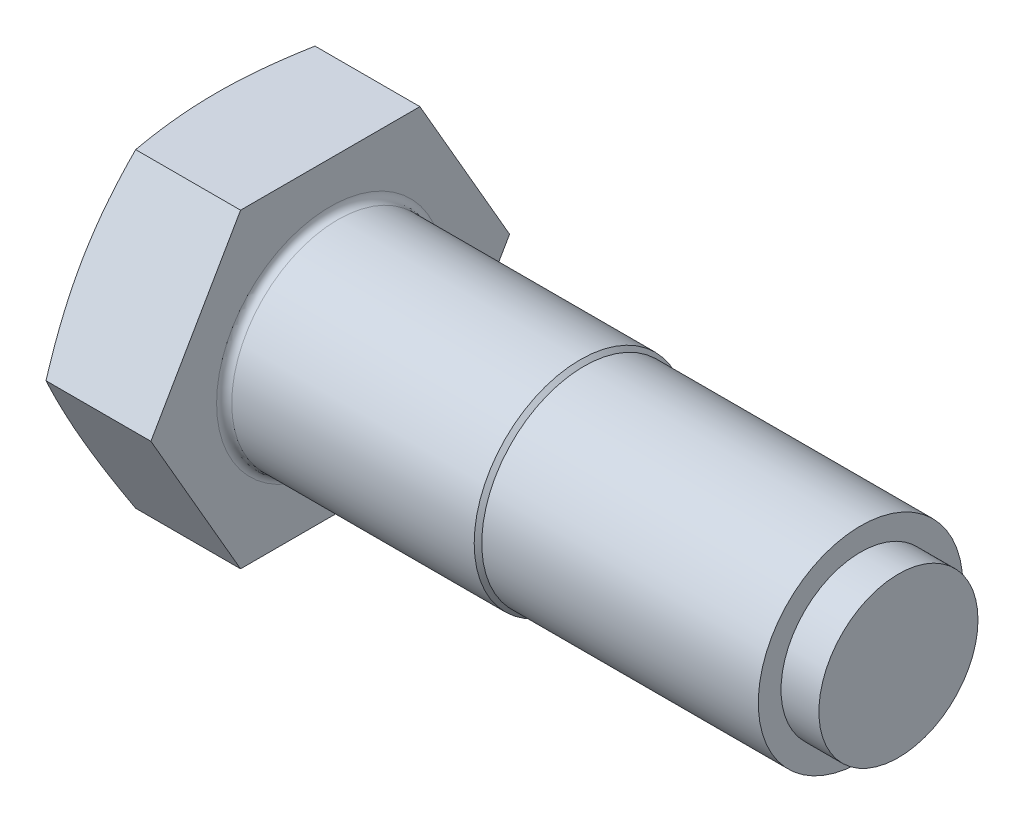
ISO-10303-21;
HEADER;
FILE_DESCRIPTION(('STEP AP214'),'2;1');
FILE_NAME('part.step','',(''),(''),'','','');
FILE_SCHEMA(('AUTOMOTIVE_DESIGN { 1 0 10303 214 1 1 1 1 }'));
ENDSEC;
DATA;
#1=APPLICATION_CONTEXT('core data for automotive mechanical design processes');
#2=APPLICATION_PROTOCOL_DEFINITION('international standard','automotive_design',2000,#1);
#3=PRODUCT_CONTEXT('',#1,'mechanical');
#4=PRODUCT('Part','Part','',(#3));
#5=PRODUCT_RELATED_PRODUCT_CATEGORY('part','',(#4));
#6=PRODUCT_DEFINITION_FORMATION('','',#4);
#7=PRODUCT_DEFINITION_CONTEXT('part definition',#1,'design');
#8=PRODUCT_DEFINITION('design','',#6,#7);
#9=PRODUCT_DEFINITION_SHAPE('','',#8);
#10=(LENGTH_UNIT() NAMED_UNIT(*) SI_UNIT(.MILLI.,.METRE.));
#11=(NAMED_UNIT(*) PLANE_ANGLE_UNIT() SI_UNIT($,.RADIAN.));
#12=(NAMED_UNIT(*) SI_UNIT($,.STERADIAN.) SOLID_ANGLE_UNIT());
#13=UNCERTAINTY_MEASURE_WITH_UNIT(LENGTH_MEASURE(1.E-05),#10,'distance_accuracy_value','');
#14=(GEOMETRIC_REPRESENTATION_CONTEXT(3) GLOBAL_UNCERTAINTY_ASSIGNED_CONTEXT((#13)) GLOBAL_UNIT_ASSIGNED_CONTEXT((#10,
#11,#12)) REPRESENTATION_CONTEXT('',''));
#15=CARTESIAN_POINT('',(0.,0.,0.));
#16=DIRECTION('',(0.,0.,1.));
#17=DIRECTION('',(1.,0.,0.));
#18=AXIS2_PLACEMENT_3D('',#15,#16,#17);
#19=CARTESIAN_POINT('',(15.,-20.5,-11.8356805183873));
#20=DIRECTION('',(0.,0.5,0.866025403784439));
#21=DIRECTION('',(0.,-0.866025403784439,0.5));
#22=AXIS2_PLACEMENT_3D('',#19,#20,#21);
#23=PLANE('',#22);
#24=CARTESIAN_POINT('',(1.15432304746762,0.00020000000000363,-23.6714765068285));
#25=CARTESIAN_POINT('',(1.06511686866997,-0.424342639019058,-23.4263666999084));
#26=CARTESIAN_POINT('',(0.979922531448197,-0.849509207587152,-23.1808966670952));
#27=CARTESIAN_POINT('',(0.818440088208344,-1.70114813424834,-22.689202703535));
#28=CARTESIAN_POINT('',(0.742152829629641,-2.12762061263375,-22.4429787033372));
#29=CARTESIAN_POINT('',(0.527901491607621,-3.40955299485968,-21.7028546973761));
#30=CARTESIAN_POINT('',(0.404673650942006,-4.26694095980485,-21.2078415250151));
#31=CARTESIAN_POINT('',(0.254912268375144,-5.55194696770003,-20.4659429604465));
#32=CARTESIAN_POINT('',(0.210965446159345,-5.97808243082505,-20.2199135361));
#33=CARTESIAN_POINT('',(0.135072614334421,-6.83114899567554,-19.7273953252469));
#34=CARTESIAN_POINT('',(0.103126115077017,-7.25808006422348,-19.4809065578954));
#35=CARTESIAN_POINT('',(0.051791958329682,-8.11236258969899,-18.9876863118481));
#36=CARTESIAN_POINT('',(0.0324000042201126,-8.53971385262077,-18.7409549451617));
#37=CARTESIAN_POINT('',(0.00650404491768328,-9.39471007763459,-18.2473226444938));
#38=CARTESIAN_POINT('',(0.,-9.8223550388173,-18.0004217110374));
#39=CARTESIAN_POINT('',(0.,-10.6776449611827,-17.5066198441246));
#40=CARTESIAN_POINT('',(0.00650404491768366,-11.1052899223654,-17.2597189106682));
#41=CARTESIAN_POINT('',(0.0324000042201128,-11.9602861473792,-16.7660866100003));
#42=CARTESIAN_POINT('',(0.0517919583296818,-12.387637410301,-16.5193552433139));
#43=CARTESIAN_POINT('',(0.103126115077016,-13.2419199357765,-16.0261349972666));
#44=CARTESIAN_POINT('',(0.135072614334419,-13.6688510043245,-15.7796462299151));
#45=CARTESIAN_POINT('',(0.210965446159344,-14.5219175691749,-15.287128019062));
#46=CARTESIAN_POINT('',(0.254912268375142,-14.9480530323,-15.0410985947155));
#47=CARTESIAN_POINT('',(0.404673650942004,-16.2330590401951,-14.2992000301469));
#48=CARTESIAN_POINT('',(0.527901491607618,-17.0904470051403,-13.8041868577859));
#49=CARTESIAN_POINT('',(0.742152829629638,-18.3723793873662,-13.0640628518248));
#50=CARTESIAN_POINT('',(0.818440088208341,-18.7988518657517,-12.817838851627));
#51=CARTESIAN_POINT('',(0.979922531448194,-19.6504907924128,-12.3261448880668));
#52=CARTESIAN_POINT('',(1.06511686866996,-20.0756573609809,-12.0806748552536));
#53=CARTESIAN_POINT('',(1.15432304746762,-20.5002,-11.8355650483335));
#54=B_SPLINE_CURVE_WITH_KNOTS('',3,(#24,#25,#26,#27,#28,#29,#30,#31,#32,#33,#34,#35,#36,#37,#38,
#39,#40,#41,#42,#43,#44,#45,#46,#47,#48,#49,#50,#51,#52,#53),.UNSPECIFIED.,.F.,.F.,(4,2,2,2,2,2,
2,2,2,2,2,2,2,2,4),(0.,1.49476565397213,2.98967340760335,5.98155544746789,7.46349089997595,
8.94536587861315,10.4267334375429,11.9080964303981,13.3894594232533,14.8708269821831,
16.3527019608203,17.8346374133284,20.8265194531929,22.3214272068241,23.8161928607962),.UNSPECIFIED.);
#55=CARTESIAN_POINT('',(1.15428101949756,0.,-23.6713610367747));
#56=VERTEX_POINT('',#55);
#57=CARTESIAN_POINT('',(0.,-10.25,-17.753520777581));
#58=VERTEX_POINT('',#57);
#59=EDGE_CURVE('E113',#56,#58,#54,.T.);
#60=ORIENTED_EDGE('',*,*,#59,.F.);
#61=DIRECTION('',(-1.,0.,0.));
#62=VECTOR('',#61,1.);
#63=CARTESIAN_POINT('',(15.,0.,-23.6713610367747));
#64=LINE('',#63,#62);
#65=CARTESIAN_POINT('',(15.,0.,-23.6713610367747));
#66=VERTEX_POINT('',#65);
#67=EDGE_CURVE('E142',#66,#56,#64,.T.);
#68=ORIENTED_EDGE('',*,*,#67,.F.);
#69=DIRECTION('',(0.,0.866025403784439,-0.5));
#70=VECTOR('',#69,1.);
#71=CARTESIAN_POINT('',(15.,-20.5,-11.8356805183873));
#72=LINE('',#71,#70);
#73=CARTESIAN_POINT('',(15.,-20.5,-11.8356805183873));
#74=VERTEX_POINT('',#73);
#75=EDGE_CURVE('E179',#74,#66,#72,.T.);
#76=ORIENTED_EDGE('',*,*,#75,.F.);
#77=DIRECTION('',(-1.,0.,0.));
#78=VECTOR('',#77,1.);
#79=CARTESIAN_POINT('',(15.,-20.5,-11.8356805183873));
#80=LINE('',#79,#78);
#81=CARTESIAN_POINT('',(1.15428101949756,-20.5,-11.8356805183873));
#82=VERTEX_POINT('',#81);
#83=EDGE_CURVE('E136',#74,#82,#80,.T.);
#84=ORIENTED_EDGE('',*,*,#83,.T.);
#85=EDGE_CURVE('E200',#58,#82,#54,.T.);
#86=ORIENTED_EDGE('',*,*,#85,.F.);
#87=EDGE_LOOP('',(#60,#68,#76,#84,#86));
#88=FACE_BOUND('',#87,.T.);
#89=ADVANCED_FACE('F35',(#88),#23,.F.);
#90=CARTESIAN_POINT('',(15.,0.,-23.6713610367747));
#91=DIRECTION('',(0.,-0.5,0.866025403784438));
#92=DIRECTION('',(0.,-0.866025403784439,-0.5));
#93=AXIS2_PLACEMENT_3D('',#90,#91,#92);
#94=PLANE('',#93);
#95=CARTESIAN_POINT('',(1.15432304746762,20.5002,-11.8355650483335));
#96=CARTESIAN_POINT('',(1.06511686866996,20.0756573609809,-12.0806748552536));
#97=CARTESIAN_POINT('',(0.979922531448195,19.6504907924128,-12.3261448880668));
#98=CARTESIAN_POINT('',(0.818440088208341,18.7988518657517,-12.817838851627));
#99=CARTESIAN_POINT('',(0.742152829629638,18.3723793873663,-13.0640628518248));
#100=CARTESIAN_POINT('',(0.527901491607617,17.0904470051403,-13.8041868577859));
#101=CARTESIAN_POINT('',(0.404673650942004,16.2330590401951,-14.2992000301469));
#102=CARTESIAN_POINT('',(0.254912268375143,14.9480530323,-15.0410985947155));
#103=CARTESIAN_POINT('',(0.210965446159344,14.5219175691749,-15.2871280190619));
#104=CARTESIAN_POINT('',(0.13507261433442,13.6688510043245,-15.779646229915));
#105=CARTESIAN_POINT('',(0.103126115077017,13.2419199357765,-16.0261349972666));
#106=CARTESIAN_POINT('',(0.0517919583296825,12.387637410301,-16.5193552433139));
#107=CARTESIAN_POINT('',(0.0324000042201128,11.9602861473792,-16.7660866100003));
#108=CARTESIAN_POINT('',(0.00650404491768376,11.1052899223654,-17.2597189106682));
#109=CARTESIAN_POINT('',(0.,10.6776449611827,-17.5066198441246));
#110=CARTESIAN_POINT('',(0.,9.8223550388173,-18.0004217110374));
#111=CARTESIAN_POINT('',(0.00650404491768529,9.3947100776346,-18.2473226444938));
#112=CARTESIAN_POINT('',(0.0324000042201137,8.53971385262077,-18.7409549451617));
#113=CARTESIAN_POINT('',(0.051791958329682,8.11236258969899,-18.9876863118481));
#114=CARTESIAN_POINT('',(0.103126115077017,7.25808006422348,-19.4809065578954));
#115=CARTESIAN_POINT('',(0.13507261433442,6.83114899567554,-19.7273953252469));
#116=CARTESIAN_POINT('',(0.210965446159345,5.97808243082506,-20.2199135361));
#117=CARTESIAN_POINT('',(0.254912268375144,5.55194696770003,-20.4659429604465));
#118=CARTESIAN_POINT('',(0.404673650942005,4.26694095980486,-21.2078415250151));
#119=CARTESIAN_POINT('',(0.527901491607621,3.40955299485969,-21.7028546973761));
#120=CARTESIAN_POINT('',(0.742152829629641,2.12762061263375,-22.4429787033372));
#121=CARTESIAN_POINT('',(0.818440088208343,1.70114813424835,-22.689202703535));
#122=CARTESIAN_POINT('',(0.979922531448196,0.849509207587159,-23.1808966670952));
#123=CARTESIAN_POINT('',(1.06511686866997,0.424342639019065,-23.4263666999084));
#124=CARTESIAN_POINT('',(1.15432304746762,-0.000199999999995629,-23.6714765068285));
#125=B_SPLINE_CURVE_WITH_KNOTS('',3,(#95,#96,#97,#98,#99,#100,#101,#102,#103,#104,#105,#106,
#107,#108,#109,#110,#111,#112,#113,#114,#115,#116,#117,#118,#119,#120,#121,#122,#123,#124),
.UNSPECIFIED.,.F.,.F.,(4,2,2,2,2,2,2,2,2,2,2,2,2,2,4),(0.,1.49476565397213,2.98967340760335,
5.98155544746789,7.46349089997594,8.94536587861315,10.4267334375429,11.9080964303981,
13.3894594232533,14.8708269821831,16.3527019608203,17.8346374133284,20.8265194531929,
22.3214272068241,23.8161928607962),.UNSPECIFIED.);
#126=CARTESIAN_POINT('',(1.15428101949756,20.5,-11.8356805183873));
#127=VERTEX_POINT('',#126);
#128=CARTESIAN_POINT('',(0.,10.25,-17.753520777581));
#129=VERTEX_POINT('',#128);
#130=EDGE_CURVE('E252',#127,#129,#125,.T.);
#131=ORIENTED_EDGE('',*,*,#130,.F.);
#132=DIRECTION('',(-1.,0.,0.));
#133=VECTOR('',#132,1.);
#134=CARTESIAN_POINT('',(15.,20.5,-11.8356805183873));
#135=LINE('',#134,#133);
#136=CARTESIAN_POINT('',(15.,20.5,-11.8356805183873));
#137=VERTEX_POINT('',#136);
#138=EDGE_CURVE('E133',#137,#127,#135,.T.);
#139=ORIENTED_EDGE('',*,*,#138,.F.);
#140=DIRECTION('',(0.,0.866025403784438,0.5));
#141=VECTOR('',#140,1.);
#142=CARTESIAN_POINT('',(15.,0.,-23.6713610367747));
#143=LINE('',#142,#141);
#144=EDGE_CURVE('E182',#66,#137,#143,.T.);
#145=ORIENTED_EDGE('',*,*,#144,.F.);
#146=ORIENTED_EDGE('',*,*,#67,.T.);
#147=EDGE_CURVE('E125',#129,#56,#125,.T.);
#148=ORIENTED_EDGE('',*,*,#147,.F.);
#149=EDGE_LOOP('',(#131,#139,#145,#146,#148));
#150=FACE_BOUND('',#149,.T.);
#151=ADVANCED_FACE('F258',(#150),#94,.F.);
#152=CARTESIAN_POINT('',(15.,20.5,-11.8356805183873));
#153=DIRECTION('',(0.,-1.,0.));
#154=DIRECTION('',(0.,0.,-1.));
#155=AXIS2_PLACEMENT_3D('',#152,#153,#154);
#156=PLANE('',#155);
#157=CARTESIAN_POINT('',(6.16802000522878,20.5,-31.3367203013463));
#158=CARTESIAN_POINT('',(6.02677468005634,20.5,-30.8729800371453));
#159=CARTESIAN_POINT('',(5.88638353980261,20.5,-30.4089797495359));
#160=CARTESIAN_POINT('',(5.60750085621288,20.5,-29.4804058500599));
#161=CARTESIAN_POINT('',(5.46900932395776,20.5,-29.0158322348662));
#162=CARTESIAN_POINT('',(5.05665312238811,20.5,-27.6211108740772));
#163=CARTESIAN_POINT('',(4.78592778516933,20.5,-26.6900311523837));
#164=CARTESIAN_POINT('',(4.25428153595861,20.5,-24.8231913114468));
#165=CARTESIAN_POINT('',(3.99337985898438,20.5,-23.8874257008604));
#166=CARTESIAN_POINT('',(3.4844130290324,20.5,-22.012414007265));
#167=CARTESIAN_POINT('',(3.23634764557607,20.5,-21.0731679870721));
#168=CARTESIAN_POINT('',(2.75919939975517,20.5,-19.2021753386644));
#169=CARTESIAN_POINT('',(2.52992020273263,20.5,-18.2704790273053));
#170=CARTESIAN_POINT('',(2.09088187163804,20.5,-16.4024501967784));
#171=CARTESIAN_POINT('',(1.88112306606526,20.5,-15.466117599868));
#172=CARTESIAN_POINT('',(1.48601627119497,20.5,-13.5886066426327));
#173=CARTESIAN_POINT('',(1.30065995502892,20.5,-12.6474300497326));
#174=CARTESIAN_POINT('',(0.960002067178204,20.5,-10.7596126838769));
#175=CARTESIAN_POINT('',(0.804699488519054,20.5,-9.81297209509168));
#176=CARTESIAN_POINT('',(0.545835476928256,20.5,-8.02082218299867));
#177=CARTESIAN_POINT('',(0.438425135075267,20.5,-7.17587403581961));
#178=CARTESIAN_POINT('',(0.256605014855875,20.5,-5.48240488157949));
#179=CARTESIAN_POINT('',(0.182194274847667,20.5,-4.63388397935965));
#180=CARTESIAN_POINT('',(0.0699568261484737,20.5,-2.93499042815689));
#181=CARTESIAN_POINT('',(0.0321042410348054,20.5,-2.08461951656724));
#182=CARTESIAN_POINT('',(-0.00510042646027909,20.5,-0.383026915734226));
#183=CARTESIAN_POINT('',(-0.00445278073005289,20.5,0.46819476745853));
#184=CARTESIAN_POINT('',(0.0354086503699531,20.5,2.17403898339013));
#185=CARTESIAN_POINT('',(0.074818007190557,20.5,3.02865687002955));
#186=CARTESIAN_POINT('',(0.19038923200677,20.5,4.73538241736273));
#187=CARTESIAN_POINT('',(0.266551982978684,20.5,5.58749001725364));
#188=CARTESIAN_POINT('',(0.452067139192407,20.5,7.2887742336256));
#189=CARTESIAN_POINT('',(0.561448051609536,20.5,8.13794769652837));
#190=CARTESIAN_POINT('',(0.808962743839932,20.5,9.83204641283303));
#191=CARTESIAN_POINT('',(0.947096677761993,20.5,10.6769716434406));
#192=CARTESIAN_POINT('',(1.2555704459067,20.5,12.4070352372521));
#193=CARTESIAN_POINT('',(1.42722732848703,20.5,13.2919366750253));
#194=CARTESIAN_POINT('',(1.79263434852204,20.5,15.0571953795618));
#195=CARTESIAN_POINT('',(1.98638615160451,20.5,15.9375522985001));
#196=CARTESIAN_POINT('',(2.39191462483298,20.5,17.6943492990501));
#197=CARTESIAN_POINT('',(2.60369652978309,20.5,18.5707881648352));
#198=CARTESIAN_POINT('',(3.04184013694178,20.5,20.319973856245));
#199=CARTESIAN_POINT('',(3.26820148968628,20.5,21.1927207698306));
#200=CARTESIAN_POINT('',(3.73307707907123,20.5,22.9361609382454));
#201=CARTESIAN_POINT('',(3.97160654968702,20.5,23.8068501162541));
#202=CARTESIAN_POINT('',(4.45836861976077,20.5,25.5455082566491));
#203=CARTESIAN_POINT('',(4.70660126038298,20.5,26.4134772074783));
#204=CARTESIAN_POINT('',(5.21099367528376,20.5,28.1469457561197));
#205=CARTESIAN_POINT('',(5.46715211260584,20.5,29.0124457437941));
#206=CARTESIAN_POINT('',(5.98605867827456,20.5,30.741462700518));
#207=CARTESIAN_POINT('',(6.24880679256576,20.5,31.6049796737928));
#208=CARTESIAN_POINT('',(6.77686389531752,20.5,33.320796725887));
#209=CARTESIAN_POINT('',(7.04211258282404,20.5,34.1731153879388));
#210=CARTESIAN_POINT('',(7.57712825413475,20.5,35.8763320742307));
#211=CARTESIAN_POINT('',(7.84689523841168,20.5,36.7272300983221));
#212=CARTESIAN_POINT('',(8.39026893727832,20.5,38.4278412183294));
#213=CARTESIAN_POINT('',(8.6638758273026,20.5,39.2775542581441));
#214=CARTESIAN_POINT('',(9.21435440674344,20.5,40.9759223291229));
#215=CARTESIAN_POINT('',(9.49122609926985,20.5,41.8245773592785));
#216=CARTESIAN_POINT('',(10.0467154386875,20.5,43.5177478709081));
#217=CARTESIAN_POINT('',(10.3253224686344,20.5,44.3622668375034));
#218=CARTESIAN_POINT('',(10.8849406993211,20.5,46.0505080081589));
#219=CARTESIAN_POINT('',(11.1659519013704,20.5,46.894230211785));
#220=CARTESIAN_POINT('',(11.7300385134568,20.5,48.5809071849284));
#221=CARTESIAN_POINT('',(12.0131137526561,20.5,49.4238620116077));
#222=CARTESIAN_POINT('',(12.5810959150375,20.5,51.1091521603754));
#223=CARTESIAN_POINT('',(12.8660028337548,20.5,51.9514874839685));
#224=CARTESIAN_POINT('',(13.1516986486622,20.5,52.7935545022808));
#225=B_SPLINE_CURVE_WITH_KNOTS('',3,(#157,#158,#159,#160,#161,#162,#163,#164,#165,#166,#167,
#168,#169,#170,#171,#172,#173,#174,#175,#176,#177,#178,#179,#180,#181,#182,#183,#184,#185,#186,
#187,#188,#189,#190,#191,#192,#193,#194,#195,#196,#197,#198,#199,#200,#201,#202,#203,#204,#205,
#206,#207,#208,#209,#210,#211,#212,#213,#214,#215,#216,#217,#218,#219,#220,#221,#222,#223,#224),
.UNSPECIFIED.,.F.,.F.,(4,2,2,2,2,2,2,2,2,2,2,2,2,2,2,2,2,2,2,2,2,2,2,2,2,2,2,2,2,2,2,2,2,4),(0.,
1.45431873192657,2.90864594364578,5.81751535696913,8.73181199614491,11.6460562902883,
14.5243694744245,17.4027310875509,20.2801079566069,23.1573884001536,25.7120708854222,
28.2666789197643,30.8194774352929,33.3722579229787,35.9379848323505,38.5037733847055,
41.0717700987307,43.6397805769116,46.3436259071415,49.0476752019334,51.7525122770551,
54.4572845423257,57.1655304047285,59.8737877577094,62.5815907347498,65.2893879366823,
67.9672895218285,70.6451913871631,73.3232159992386,76.0012431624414,78.6691047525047,
81.3369677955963,84.0046124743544,86.6722506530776),.UNSPECIFIED.);
#226=CARTESIAN_POINT('',(1.15428101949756,20.5,11.8356805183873));
#227=VERTEX_POINT('',#226);
#228=CARTESIAN_POINT('',(0.,20.5,0.));
#229=VERTEX_POINT('',#228);
#230=EDGE_CURVE('E50',#227,#229,#225,.F.);
#231=ORIENTED_EDGE('',*,*,#230,.F.);
#232=DIRECTION('',(-1.,0.,0.));
#233=VECTOR('',#232,1.);
#234=CARTESIAN_POINT('',(15.,20.5,11.8356805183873));
#235=LINE('',#234,#233);
#236=CARTESIAN_POINT('',(15.,20.5,11.8356805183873));
#237=VERTEX_POINT('',#236);
#238=EDGE_CURVE('E130',#237,#227,#235,.T.);
#239=ORIENTED_EDGE('',*,*,#238,.F.);
#240=DIRECTION('',(0.,0.,1.));
#241=VECTOR('',#240,1.);
#242=CARTESIAN_POINT('',(15.,20.5,-11.8356805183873));
#243=LINE('',#242,#241);
#244=EDGE_CURVE('E188',#137,#237,#243,.T.);
#245=ORIENTED_EDGE('',*,*,#244,.F.);
#246=ORIENTED_EDGE('',*,*,#138,.T.);
#247=EDGE_CURVE('E253',#229,#127,#225,.F.);
#248=ORIENTED_EDGE('',*,*,#247,.F.);
#249=EDGE_LOOP('',(#231,#239,#245,#246,#248));
#250=FACE_BOUND('',#249,.T.);
#251=ADVANCED_FACE('F261',(#250),#156,.F.);
#252=CARTESIAN_POINT('',(15.,20.5,11.8356805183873));
#253=DIRECTION('',(0.,-0.5,-0.866025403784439));
#254=DIRECTION('',(0.,0.866025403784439,-0.5));
#255=AXIS2_PLACEMENT_3D('',#252,#253,#254);
#256=PLANE('',#255);
#257=CARTESIAN_POINT('',(1.15432304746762,-0.000199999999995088,23.6714765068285));
#258=CARTESIAN_POINT('',(1.06511686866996,0.424342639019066,23.4263666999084));
#259=CARTESIAN_POINT('',(0.979922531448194,0.84950920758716,23.1808966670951));
#260=CARTESIAN_POINT('',(0.818440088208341,1.70114813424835,22.6892027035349));
#261=CARTESIAN_POINT('',(0.742152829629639,2.12762061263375,22.4429787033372));
#262=CARTESIAN_POINT('',(0.527901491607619,3.40955299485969,21.7028546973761));
#263=CARTESIAN_POINT('',(0.404673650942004,4.26694095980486,21.2078415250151));
#264=CARTESIAN_POINT('',(0.254912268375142,5.55194696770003,20.4659429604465));
#265=CARTESIAN_POINT('',(0.210965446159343,5.97808243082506,20.2199135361));
#266=CARTESIAN_POINT('',(0.135072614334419,6.83114899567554,19.7273953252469));
#267=CARTESIAN_POINT('',(0.103126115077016,7.25808006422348,19.4809065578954));
#268=CARTESIAN_POINT('',(0.0517919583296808,8.11236258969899,18.9876863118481));
#269=CARTESIAN_POINT('',(0.032400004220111,8.53971385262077,18.7409549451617));
#270=CARTESIAN_POINT('',(0.00650404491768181,9.3947100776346,18.2473226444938));
#271=CARTESIAN_POINT('',(0.,9.8223550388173,18.0004217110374));
#272=CARTESIAN_POINT('',(0.,10.6776449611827,17.5066198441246));
#273=CARTESIAN_POINT('',(0.00650404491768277,11.1052899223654,17.2597189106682));
#274=CARTESIAN_POINT('',(0.0324000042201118,11.9602861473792,16.7660866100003));
#275=CARTESIAN_POINT('',(0.0517919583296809,12.387637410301,16.5193552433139));
#276=CARTESIAN_POINT('',(0.103126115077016,13.2419199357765,16.0261349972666));
#277=CARTESIAN_POINT('',(0.135072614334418,13.6688510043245,15.7796462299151));
#278=CARTESIAN_POINT('',(0.210965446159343,14.5219175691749,15.287128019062));
#279=CARTESIAN_POINT('',(0.254912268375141,14.9480530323,15.0410985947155));
#280=CARTESIAN_POINT('',(0.404673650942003,16.2330590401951,14.2992000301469));
#281=CARTESIAN_POINT('',(0.527901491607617,17.0904470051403,13.8041868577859));
#282=CARTESIAN_POINT('',(0.742152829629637,18.3723793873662,13.0640628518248));
#283=CARTESIAN_POINT('',(0.818440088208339,18.7988518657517,12.817838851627));
#284=CARTESIAN_POINT('',(0.979922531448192,19.6504907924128,12.3261448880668));
#285=CARTESIAN_POINT('',(1.06511686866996,20.0756573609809,12.0806748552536));
#286=CARTESIAN_POINT('',(1.15432304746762,20.5002,11.8355650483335));
#287=B_SPLINE_CURVE_WITH_KNOTS('',3,(#257,#258,#259,#260,#261,#262,#263,#264,#265,#266,#267,
#268,#269,#270,#271,#272,#273,#274,#275,#276,#277,#278,#279,#280,#281,#282,#283,#284,#285,#286),
.UNSPECIFIED.,.F.,.F.,(4,2,2,2,2,2,2,2,2,2,2,2,2,2,4),(0.,1.49476565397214,2.98967340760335,
5.98155544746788,7.46349089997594,8.94536587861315,10.4267334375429,11.9080964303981,
13.3894594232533,14.8708269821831,16.3527019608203,17.8346374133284,20.8265194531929,
22.3214272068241,23.8161928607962),.UNSPECIFIED.);
#288=CARTESIAN_POINT('',(1.15428101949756,0.,23.6713610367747));
#289=VERTEX_POINT('',#288);
#290=CARTESIAN_POINT('',(0.,10.25,17.753520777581));
#291=VERTEX_POINT('',#290);
#292=EDGE_CURVE('E58',#289,#291,#287,.T.);
#293=ORIENTED_EDGE('',*,*,#292,.F.);
#294=DIRECTION('',(-1.,0.,0.));
#295=VECTOR('',#294,1.);
#296=CARTESIAN_POINT('',(15.,0.,23.6713610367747));
#297=LINE('',#296,#295);
#298=CARTESIAN_POINT('',(15.,0.,23.6713610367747));
#299=VERTEX_POINT('',#298);
#300=EDGE_CURVE('E121',#299,#289,#297,.T.);
#301=ORIENTED_EDGE('',*,*,#300,.F.);
#302=DIRECTION('',(0.,-0.866025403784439,0.5));
#303=VECTOR('',#302,1.);
#304=CARTESIAN_POINT('',(15.,20.5,11.8356805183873));
#305=LINE('',#304,#303);
#306=EDGE_CURVE('E190',#237,#299,#305,.T.);
#307=ORIENTED_EDGE('',*,*,#306,.F.);
#308=ORIENTED_EDGE('',*,*,#238,.T.);
#309=EDGE_CURVE('E124',#291,#227,#287,.T.);
#310=ORIENTED_EDGE('',*,*,#309,.F.);
#311=EDGE_LOOP('',(#293,#301,#307,#308,#310));
#312=FACE_BOUND('',#311,.T.);
#313=ADVANCED_FACE('F119',(#312),#256,.F.);
#314=CARTESIAN_POINT('',(15.,0.,23.6713610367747));
#315=DIRECTION('',(0.,0.5,-0.866025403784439));
#316=DIRECTION('',(0.,0.866025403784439,0.5));
#317=AXIS2_PLACEMENT_3D('',#314,#315,#316);
#318=PLANE('',#317);
#319=CARTESIAN_POINT('',(1.15432304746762,-20.5002,11.8355650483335));
#320=CARTESIAN_POINT('',(1.06511686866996,-20.0756573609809,12.0806748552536));
#321=CARTESIAN_POINT('',(0.979922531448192,-19.6504907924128,12.3261448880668));
#322=CARTESIAN_POINT('',(0.818440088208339,-18.7988518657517,12.817838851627));
#323=CARTESIAN_POINT('',(0.742152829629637,-18.3723793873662,13.0640628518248));
#324=CARTESIAN_POINT('',(0.527901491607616,-17.0904470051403,13.8041868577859));
#325=CARTESIAN_POINT('',(0.404673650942,-16.2330590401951,14.2992000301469));
#326=CARTESIAN_POINT('',(0.254912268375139,-14.9480530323,15.0410985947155));
#327=CARTESIAN_POINT('',(0.210965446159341,-14.5219175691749,15.2871280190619));
#328=CARTESIAN_POINT('',(0.135072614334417,-13.6688510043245,15.779646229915));
#329=CARTESIAN_POINT('',(0.103126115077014,-13.2419199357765,16.0261349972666));
#330=CARTESIAN_POINT('',(0.0517919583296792,-12.387637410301,16.5193552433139));
#331=CARTESIAN_POINT('',(0.0324000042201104,-11.9602861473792,16.7660866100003));
#332=CARTESIAN_POINT('',(0.0065040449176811,-11.1052899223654,17.2597189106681));
#333=CARTESIAN_POINT('',(0.,-10.6776449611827,17.5066198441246));
#334=CARTESIAN_POINT('',(0.,-9.82235503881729,18.0004217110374));
#335=CARTESIAN_POINT('',(0.00650404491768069,-9.39471007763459,18.2473226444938));
#336=CARTESIAN_POINT('',(0.0324000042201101,-8.53971385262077,18.7409549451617));
#337=CARTESIAN_POINT('',(0.0517919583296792,-8.11236258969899,18.9876863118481));
#338=CARTESIAN_POINT('',(0.103126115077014,-7.25808006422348,19.4809065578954));
#339=CARTESIAN_POINT('',(0.135072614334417,-6.83114899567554,19.7273953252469));
#340=CARTESIAN_POINT('',(0.210965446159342,-5.97808243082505,20.2199135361));
#341=CARTESIAN_POINT('',(0.254912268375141,-5.55194696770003,20.4659429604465));
#342=CARTESIAN_POINT('',(0.404673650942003,-4.26694095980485,21.2078415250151));
#343=CARTESIAN_POINT('',(0.527901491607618,-3.40955299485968,21.7028546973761));
#344=CARTESIAN_POINT('',(0.742152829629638,-2.12762061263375,22.4429787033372));
#345=CARTESIAN_POINT('',(0.818440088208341,-1.70114813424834,22.6892027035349));
#346=CARTESIAN_POINT('',(0.979922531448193,-0.849509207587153,23.1808966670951));
#347=CARTESIAN_POINT('',(1.06511686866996,-0.424342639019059,23.4263666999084));
#348=CARTESIAN_POINT('',(1.15432304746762,0.00020000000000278,23.6714765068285));
#349=B_SPLINE_CURVE_WITH_KNOTS('',3,(#319,#320,#321,#322,#323,#324,#325,#326,#327,#328,#329,
#330,#331,#332,#333,#334,#335,#336,#337,#338,#339,#340,#341,#342,#343,#344,#345,#346,#347,#348),
.UNSPECIFIED.,.F.,.F.,(4,2,2,2,2,2,2,2,2,2,2,2,2,2,4),(0.,1.49476565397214,2.98967340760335,
5.98155544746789,7.46349089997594,8.94536587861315,10.4267334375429,11.9080964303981,
13.3894594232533,14.8708269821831,16.3527019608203,17.8346374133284,20.8265194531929,
22.3214272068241,23.8161928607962),.UNSPECIFIED.);
#350=CARTESIAN_POINT('',(1.15428101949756,-20.5,11.8356805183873));
#351=VERTEX_POINT('',#350);
#352=CARTESIAN_POINT('',(0.,-10.25,17.753520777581));
#353=VERTEX_POINT('',#352);
#354=EDGE_CURVE('E115',#351,#353,#349,.T.);
#355=ORIENTED_EDGE('',*,*,#354,.F.);
#356=DIRECTION('',(-1.,0.,0.));
#357=VECTOR('',#356,1.);
#358=CARTESIAN_POINT('',(15.,-20.5,11.8356805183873));
#359=LINE('',#358,#357);
#360=CARTESIAN_POINT('',(15.,-20.5,11.8356805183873));
#361=VERTEX_POINT('',#360);
#362=EDGE_CURVE('E131',#361,#351,#359,.T.);
#363=ORIENTED_EDGE('',*,*,#362,.F.);
#364=DIRECTION('',(0.,-0.866025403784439,-0.5));
#365=VECTOR('',#364,1.);
#366=CARTESIAN_POINT('',(15.,0.,23.6713610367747));
#367=LINE('',#366,#365);
#368=EDGE_CURVE('E129',#299,#361,#367,.T.);
#369=ORIENTED_EDGE('',*,*,#368,.F.);
#370=ORIENTED_EDGE('',*,*,#300,.T.);
#371=EDGE_CURVE('E105',#353,#289,#349,.T.);
#372=ORIENTED_EDGE('',*,*,#371,.F.);
#373=EDGE_LOOP('',(#355,#363,#369,#370,#372));
#374=FACE_BOUND('',#373,.T.);
#375=ADVANCED_FACE('F127',(#374),#318,.F.);
#376=CARTESIAN_POINT('',(15.,-20.5,11.8356805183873));
#377=DIRECTION('',(0.,1.,0.));
#378=DIRECTION('',(0.,0.,1.));
#379=AXIS2_PLACEMENT_3D('',#376,#377,#378);
#380=PLANE('',#379);
#381=CARTESIAN_POINT('',(6.16802000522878,-20.5,-31.3367203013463));
#382=CARTESIAN_POINT('',(6.02677468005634,-20.5,-30.8729800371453));
#383=CARTESIAN_POINT('',(5.88638353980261,-20.5,-30.4089797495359));
#384=CARTESIAN_POINT('',(5.60750085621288,-20.5,-29.4804058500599));
#385=CARTESIAN_POINT('',(5.46900932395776,-20.5,-29.0158322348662));
#386=CARTESIAN_POINT('',(5.05665312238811,-20.5,-27.6211108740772));
#387=CARTESIAN_POINT('',(4.78592778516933,-20.5,-26.6900311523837));
#388=CARTESIAN_POINT('',(4.25428153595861,-20.5,-24.8231913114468));
#389=CARTESIAN_POINT('',(3.99337985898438,-20.5,-23.8874257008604));
#390=CARTESIAN_POINT('',(3.4844130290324,-20.5,-22.012414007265));
#391=CARTESIAN_POINT('',(3.23634764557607,-20.5,-21.0731679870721));
#392=CARTESIAN_POINT('',(2.75919939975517,-20.5,-19.2021753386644));
#393=CARTESIAN_POINT('',(2.52992020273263,-20.5,-18.2704790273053));
#394=CARTESIAN_POINT('',(2.09088187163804,-20.5,-16.4024501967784));
#395=CARTESIAN_POINT('',(1.88112306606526,-20.5,-15.466117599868));
#396=CARTESIAN_POINT('',(1.48601627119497,-20.5,-13.5886066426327));
#397=CARTESIAN_POINT('',(1.30065995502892,-20.5,-12.6474300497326));
#398=CARTESIAN_POINT('',(0.960002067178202,-20.5,-10.7596126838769));
#399=CARTESIAN_POINT('',(0.804699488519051,-20.5,-9.81297209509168));
#400=CARTESIAN_POINT('',(0.545835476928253,-20.5,-8.02082218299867));
#401=CARTESIAN_POINT('',(0.438425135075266,-20.5,-7.17587403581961));
#402=CARTESIAN_POINT('',(0.256605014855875,-20.5,-5.48240488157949));
#403=CARTESIAN_POINT('',(0.182194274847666,-20.5,-4.63388397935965));
#404=CARTESIAN_POINT('',(0.069956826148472,-20.5,-2.93499042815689));
#405=CARTESIAN_POINT('',(0.032104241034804,-20.5,-2.08461951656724));
#406=CARTESIAN_POINT('',(-0.00510042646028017,-20.5,-0.383026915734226));
#407=CARTESIAN_POINT('',(-0.00445278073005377,-20.5,0.468194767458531));
#408=CARTESIAN_POINT('',(0.0354086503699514,-20.5,2.17403898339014));
#409=CARTESIAN_POINT('',(0.0748180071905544,-20.5,3.02865687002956));
#410=CARTESIAN_POINT('',(0.190389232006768,-20.5,4.73538241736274));
#411=CARTESIAN_POINT('',(0.266551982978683,-20.5,5.58749001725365));
#412=CARTESIAN_POINT('',(0.452067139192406,-20.5,7.2887742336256));
#413=CARTESIAN_POINT('',(0.561448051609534,-20.5,8.13794769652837));
#414=CARTESIAN_POINT('',(0.80896274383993,-20.5,9.83204641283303));
#415=CARTESIAN_POINT('',(0.947096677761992,-20.5,10.6769716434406));
#416=CARTESIAN_POINT('',(1.2555704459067,-20.5,12.4070352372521));
#417=CARTESIAN_POINT('',(1.42722732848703,-20.5,13.2919366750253));
#418=CARTESIAN_POINT('',(1.79263434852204,-20.5,15.0571953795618));
#419=CARTESIAN_POINT('',(1.98638615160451,-20.5,15.9375522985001));
#420=CARTESIAN_POINT('',(2.39191462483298,-20.5,17.6943492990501));
#421=CARTESIAN_POINT('',(2.60369652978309,-20.5,18.5707881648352));
#422=CARTESIAN_POINT('',(3.04184013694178,-20.5,20.319973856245));
#423=CARTESIAN_POINT('',(3.26820148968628,-20.5,21.1927207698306));
#424=CARTESIAN_POINT('',(3.73307707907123,-20.5,22.9361609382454));
#425=CARTESIAN_POINT('',(3.97160654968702,-20.5,23.8068501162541));
#426=CARTESIAN_POINT('',(4.45836861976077,-20.5,25.5455082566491));
#427=CARTESIAN_POINT('',(4.70660126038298,-20.5,26.4134772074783));
#428=CARTESIAN_POINT('',(5.21099367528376,-20.5,28.1469457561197));
#429=CARTESIAN_POINT('',(5.46715211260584,-20.5,29.0124457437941));
#430=CARTESIAN_POINT('',(5.98605867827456,-20.5,30.741462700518));
#431=CARTESIAN_POINT('',(6.24880679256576,-20.5,31.6049796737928));
#432=CARTESIAN_POINT('',(6.77686389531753,-20.5,33.320796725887));
#433=CARTESIAN_POINT('',(7.04211258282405,-20.5,34.1731153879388));
#434=CARTESIAN_POINT('',(7.57712825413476,-20.5,35.8763320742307));
#435=CARTESIAN_POINT('',(7.84689523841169,-20.5,36.7272300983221));
#436=CARTESIAN_POINT('',(8.39026893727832,-20.5,38.4278412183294));
#437=CARTESIAN_POINT('',(8.6638758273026,-20.5,39.2775542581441));
#438=CARTESIAN_POINT('',(9.21435440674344,-20.5,40.9759223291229));
#439=CARTESIAN_POINT('',(9.49122609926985,-20.5,41.8245773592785));
#440=CARTESIAN_POINT('',(10.0467154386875,-20.5,43.5177478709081));
#441=CARTESIAN_POINT('',(10.3253224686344,-20.5,44.3622668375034));
#442=CARTESIAN_POINT('',(10.8849406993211,-20.5,46.0505080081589));
#443=CARTESIAN_POINT('',(11.1659519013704,-20.5,46.894230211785));
#444=CARTESIAN_POINT('',(11.7300385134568,-20.5,48.5809071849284));
#445=CARTESIAN_POINT('',(12.0131137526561,-20.5,49.4238620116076));
#446=CARTESIAN_POINT('',(12.5810959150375,-20.5,51.1091521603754));
#447=CARTESIAN_POINT('',(12.8660028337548,-20.5,51.9514874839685));
#448=CARTESIAN_POINT('',(13.1516986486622,-20.5,52.7935545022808));
#449=B_SPLINE_CURVE_WITH_KNOTS('',3,(#381,#382,#383,#384,#385,#386,#387,#388,#389,#390,#391,
#392,#393,#394,#395,#396,#397,#398,#399,#400,#401,#402,#403,#404,#405,#406,#407,#408,#409,#410,
#411,#412,#413,#414,#415,#416,#417,#418,#419,#420,#421,#422,#423,#424,#425,#426,#427,#428,#429,
#430,#431,#432,#433,#434,#435,#436,#437,#438,#439,#440,#441,#442,#443,#444,#445,#446,#447,#448),
.UNSPECIFIED.,.F.,.F.,(4,2,2,2,2,2,2,2,2,2,2,2,2,2,2,2,2,2,2,2,2,2,2,2,2,2,2,2,2,2,2,2,2,4),(0.,
1.45431873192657,2.90864594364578,5.81751535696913,8.73181199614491,11.6460562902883,
14.5243694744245,17.4027310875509,20.2801079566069,23.1573884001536,25.7120708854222,
28.2666789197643,30.8194774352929,33.3722579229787,35.9379848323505,38.5037733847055,
41.0717700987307,43.6397805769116,46.3436259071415,49.0476752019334,51.7525122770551,
54.4572845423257,57.1655304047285,59.8737877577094,62.5815907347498,65.2893879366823,
67.9672895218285,70.6451913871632,73.3232159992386,76.0012431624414,78.6691047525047,
81.3369677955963,84.0046124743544,86.6722506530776),.UNSPECIFIED.);
#450=CARTESIAN_POINT('',(0.,-20.5,0.));
#451=VERTEX_POINT('',#450);
#452=EDGE_CURVE('E208',#82,#451,#449,.T.);
#453=ORIENTED_EDGE('',*,*,#452,.F.);
#454=ORIENTED_EDGE('',*,*,#83,.F.);
#455=DIRECTION('',(0.,0.,-1.));
#456=VECTOR('',#455,1.);
#457=CARTESIAN_POINT('',(15.,-20.5,11.8356805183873));
#458=LINE('',#457,#456);
#459=EDGE_CURVE('E193',#361,#74,#458,.T.);
#460=ORIENTED_EDGE('',*,*,#459,.F.);
#461=ORIENTED_EDGE('',*,*,#362,.T.);
#462=EDGE_CURVE('E209',#451,#351,#449,.T.);
#463=ORIENTED_EDGE('',*,*,#462,.F.);
#464=EDGE_LOOP('',(#453,#454,#460,#461,#463));
#465=FACE_BOUND('',#464,.T.);
#466=ADVANCED_FACE('F205',(#465),#380,.F.);
#467=CARTESIAN_POINT('',(203.183766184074,0.,0.));
#468=DIRECTION('',(-1.,0.,0.));
#469=DIRECTION('',(0.,0.,1.));
#470=AXIS2_PLACEMENT_3D('',#467,#468,#469);
#471=CYLINDRICAL_SURFACE('',#470,13.5);
#472=CARTESIAN_POINT('',(48.5,0.,0.));
#473=DIRECTION('',(1.,0.,0.));
#474=DIRECTION('',(0.,0.,-1.));
#475=AXIS2_PLACEMENT_3D('',#472,#473,#474);
#476=CIRCLE('',#475,13.5);
#477=CARTESIAN_POINT('',(48.5,0.,-13.5));
#478=VERTEX_POINT('',#477);
#479=EDGE_CURVE('E13',#478,#478,#476,.T.);
#480=ORIENTED_EDGE('',*,*,#479,.T.);
#481=EDGE_LOOP('',(#480));
#482=FACE_BOUND('',#481,.T.);
#483=CARTESIAN_POINT('',(85.,0.,0.));
#484=DIRECTION('',(1.,0.,0.));
#485=DIRECTION('',(0.,0.,-1.));
#486=AXIS2_PLACEMENT_3D('',#483,#484,#485);
#487=CIRCLE('',#486,13.5);
#488=CARTESIAN_POINT('',(85.,0.,-13.5));
#489=VERTEX_POINT('',#488);
#490=EDGE_CURVE('E146',#489,#489,#487,.T.);
#491=ORIENTED_EDGE('',*,*,#490,.F.);
#492=EDGE_LOOP('',(#491));
#493=FACE_BOUND('',#492,.T.);
#494=ADVANCED_FACE('F273',(#482,#493),#471,.T.);
#495=CARTESIAN_POINT('',(15.,0.,-23.6713610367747));
#496=DIRECTION('',(1.,0.,0.));
#497=DIRECTION('',(0.,0.,-1.));
#498=AXIS2_PLACEMENT_3D('',#495,#496,#497);
#499=PLANE('',#498);
#500=CARTESIAN_POINT('',(15.,0.,0.));
#501=DIRECTION('',(1.,0.,0.));
#502=DIRECTION('',(0.,0.,-1.));
#503=AXIS2_PLACEMENT_3D('',#500,#501,#502);
#504=CIRCLE('',#503,15.);
#505=CARTESIAN_POINT('',(15.,0.,-15.));
#506=VERTEX_POINT('',#505);
#507=EDGE_CURVE('E43',#506,#506,#504,.F.);
#508=ORIENTED_EDGE('',*,*,#507,.T.);
#509=EDGE_LOOP('',(#508));
#510=FACE_BOUND('',#509,.T.);
#511=ORIENTED_EDGE('',*,*,#75,.T.);
#512=ORIENTED_EDGE('',*,*,#144,.T.);
#513=ORIENTED_EDGE('',*,*,#244,.T.);
#514=ORIENTED_EDGE('',*,*,#306,.T.);
#515=ORIENTED_EDGE('',*,*,#368,.T.);
#516=ORIENTED_EDGE('',*,*,#459,.T.);
#517=EDGE_LOOP('',(#511,#512,#513,#514,#515,#516));
#518=FACE_BOUND('',#517,.T.);
#519=ADVANCED_FACE('F160',(#510,#518),#499,.T.);
#520=CARTESIAN_POINT('',(48.,0.,0.));
#521=DIRECTION('',(-1.,0.,0.));
#522=DIRECTION('',(0.,0.,1.));
#523=AXIS2_PLACEMENT_3D('',#520,#521,#522);
#524=CYLINDRICAL_SURFACE('',#523,14.);
#525=CARTESIAN_POINT('',(16.,0.,0.));
#526=DIRECTION('',(1.,0.,0.));
#527=DIRECTION('',(0.,0.,-1.));
#528=AXIS2_PLACEMENT_3D('',#525,#526,#527);
#529=CIRCLE('',#528,14.);
#530=CARTESIAN_POINT('',(16.,0.,-14.));
#531=VERTEX_POINT('',#530);
#532=EDGE_CURVE('E155',#531,#531,#529,.T.);
#533=ORIENTED_EDGE('',*,*,#532,.T.);
#534=EDGE_LOOP('',(#533));
#535=FACE_BOUND('',#534,.T.);
#536=CARTESIAN_POINT('',(48.,0.,0.));
#537=DIRECTION('',(1.,0.,0.));
#538=DIRECTION('',(0.,0.,-1.));
#539=AXIS2_PLACEMENT_3D('',#536,#537,#538);
#540=CIRCLE('',#539,14.);
#541=CARTESIAN_POINT('',(48.,0.,-14.));
#542=VERTEX_POINT('',#541);
#543=EDGE_CURVE('E149',#542,#542,#540,.T.);
#544=ORIENTED_EDGE('',*,*,#543,.F.);
#545=EDGE_LOOP('',(#544));
#546=FACE_BOUND('',#545,.T.);
#547=ADVANCED_FACE('F171',(#535,#546),#524,.T.);
#548=CARTESIAN_POINT('',(85.,0.,0.));
#549=DIRECTION('',(1.,0.,0.));
#550=DIRECTION('',(0.,0.,-1.));
#551=AXIS2_PLACEMENT_3D('',#548,#549,#550);
#552=PLANE('',#551);
#553=CARTESIAN_POINT('',(85.,0.,0.));
#554=DIRECTION('',(1.,0.,0.));
#555=DIRECTION('',(0.,0.,-1.));
#556=AXIS2_PLACEMENT_3D('',#553,#554,#555);
#557=CIRCLE('',#556,10.5);
#558=CARTESIAN_POINT('',(85.,0.,-10.5));
#559=VERTEX_POINT('',#558);
#560=EDGE_CURVE('E150',#559,#559,#557,.T.);
#561=ORIENTED_EDGE('',*,*,#560,.F.);
#562=EDGE_LOOP('',(#561));
#563=FACE_BOUND('',#562,.T.);
#564=ORIENTED_EDGE('',*,*,#490,.T.);
#565=EDGE_LOOP('',(#564));
#566=FACE_BOUND('',#565,.T.);
#567=ADVANCED_FACE('F174',(#563,#566),#552,.T.);
#568=CARTESIAN_POINT('',(85.,0.,0.));
#569=DIRECTION('',(1.,0.,0.));
#570=DIRECTION('',(0.,0.,-1.));
#571=AXIS2_PLACEMENT_3D('',#568,#569,#570);
#572=CYLINDRICAL_SURFACE('',#571,10.5);
#573=ORIENTED_EDGE('',*,*,#560,.T.);
#574=EDGE_LOOP('',(#573));
#575=FACE_BOUND('',#574,.T.);
#576=CARTESIAN_POINT('',(90.,0.,0.));
#577=DIRECTION('',(1.,0.,0.));
#578=DIRECTION('',(0.,0.,-1.));
#579=AXIS2_PLACEMENT_3D('',#576,#577,#578);
#580=CIRCLE('',#579,10.5);
#581=CARTESIAN_POINT('',(90.,0.,-10.5));
#582=VERTEX_POINT('',#581);
#583=EDGE_CURVE('E416',#582,#582,#580,.T.);
#584=ORIENTED_EDGE('',*,*,#583,.F.);
#585=EDGE_LOOP('',(#584));
#586=FACE_BOUND('',#585,.T.);
#587=ADVANCED_FACE('F233',(#575,#586),#572,.T.);
#588=CARTESIAN_POINT('',(90.,0.,-23.6713610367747));
#589=DIRECTION('',(1.,0.,0.));
#590=DIRECTION('',(0.,0.,-1.));
#591=AXIS2_PLACEMENT_3D('',#588,#589,#590);
#592=PLANE('',#591);
#593=ORIENTED_EDGE('',*,*,#583,.T.);
#594=EDGE_LOOP('',(#593));
#595=FACE_BOUND('',#594,.T.);
#596=ADVANCED_FACE('F313',(#595),#592,.T.);
#597=CARTESIAN_POINT('',(0.,0.,0.));
#598=DIRECTION('',(1.,0.,0.));
#599=DIRECTION('',(0.,0.,-1.));
#600=AXIS2_PLACEMENT_3D('',#597,#598,#599);
#601=CONICAL_SURFACE('',#600,20.5,1.22173047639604);
#602=ORIENTED_EDGE('',*,*,#147,.T.);
#603=ORIENTED_EDGE('',*,*,#59,.T.);
#604=CARTESIAN_POINT('',(0.,0.,0.));
#605=DIRECTION('',(1.,0.,0.));
#606=DIRECTION('',(0.,0.,-1.));
#607=AXIS2_PLACEMENT_3D('',#604,#605,#606);
#608=CIRCLE('',#607,20.5);
#609=EDGE_CURVE('E145',#58,#129,#608,.T.);
#610=ORIENTED_EDGE('',*,*,#609,.T.);
#611=EDGE_LOOP('',(#602,#603,#610));
#612=FACE_BOUND('',#611,.T.);
#613=ADVANCED_FACE('F307',(#612),#601,.T.);
#614=ORIENTED_EDGE('',*,*,#85,.T.);
#615=ORIENTED_EDGE('',*,*,#452,.T.);
#616=EDGE_CURVE('E153',#451,#58,#608,.T.);
#617=ORIENTED_EDGE('',*,*,#616,.T.);
#618=EDGE_LOOP('',(#614,#615,#617));
#619=FACE_BOUND('',#618,.T.);
#620=ADVANCED_FACE('F312',(#619),#601,.T.);
#621=ORIENTED_EDGE('',*,*,#354,.T.);
#622=EDGE_CURVE('E428',#353,#451,#608,.T.);
#623=ORIENTED_EDGE('',*,*,#622,.T.);
#624=ORIENTED_EDGE('',*,*,#462,.T.);
#625=EDGE_LOOP('',(#621,#623,#624));
#626=FACE_BOUND('',#625,.T.);
#627=ADVANCED_FACE('F231',(#626),#601,.T.);
#628=ORIENTED_EDGE('',*,*,#292,.T.);
#629=EDGE_CURVE('E108',#291,#353,#608,.T.);
#630=ORIENTED_EDGE('',*,*,#629,.T.);
#631=ORIENTED_EDGE('',*,*,#371,.T.);
#632=EDGE_LOOP('',(#628,#630,#631));
#633=FACE_BOUND('',#632,.T.);
#634=ADVANCED_FACE('F106',(#633),#601,.T.);
#635=ORIENTED_EDGE('',*,*,#230,.T.);
#636=CARTESIAN_POINT('',(0.,0.,0.));
#637=DIRECTION('',(-1.,0.,0.));
#638=DIRECTION('',(0.,0.,1.));
#639=AXIS2_PLACEMENT_3D('',#636,#637,#638);
#640=CIRCLE('',#639,20.5);
#641=EDGE_CURVE('E212',#291,#229,#640,.T.);
#642=ORIENTED_EDGE('',*,*,#641,.F.);
#643=ORIENTED_EDGE('',*,*,#309,.T.);
#644=EDGE_LOOP('',(#635,#642,#643));
#645=FACE_BOUND('',#644,.T.);
#646=ADVANCED_FACE('F226',(#645),#601,.T.);
#647=ORIENTED_EDGE('',*,*,#247,.T.);
#648=ORIENTED_EDGE('',*,*,#130,.T.);
#649=EDGE_CURVE('E154',#129,#229,#608,.T.);
#650=ORIENTED_EDGE('',*,*,#649,.T.);
#651=EDGE_LOOP('',(#647,#648,#650));
#652=FACE_BOUND('',#651,.T.);
#653=ADVANCED_FACE('F230',(#652),#601,.T.);
#654=CARTESIAN_POINT('',(0.,0.,-23.6713610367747));
#655=DIRECTION('',(1.,0.,0.));
#656=DIRECTION('',(0.,0.,-1.));
#657=AXIS2_PLACEMENT_3D('',#654,#655,#656);
#658=PLANE('',#657);
#659=ORIENTED_EDGE('',*,*,#649,.F.);
#660=ORIENTED_EDGE('',*,*,#609,.F.);
#661=ORIENTED_EDGE('',*,*,#616,.F.);
#662=ORIENTED_EDGE('',*,*,#622,.F.);
#663=ORIENTED_EDGE('',*,*,#629,.F.);
#664=ORIENTED_EDGE('',*,*,#641,.T.);
#665=EDGE_LOOP('',(#659,#660,#661,#662,#663,#664));
#666=FACE_BOUND('',#665,.T.);
#667=ADVANCED_FACE('F167',(#666),#658,.F.);
#668=CARTESIAN_POINT('',(16.,0.,0.));
#669=DIRECTION('',(1.,0.,0.));
#670=DIRECTION('',(0.,0.,-1.));
#671=AXIS2_PLACEMENT_3D('',#668,#669,#670);
#672=TOROIDAL_SURFACE('',#671,15.,1.);
#673=ORIENTED_EDGE('',*,*,#507,.F.);
#674=EDGE_LOOP('',(#673));
#675=FACE_BOUND('',#674,.T.);
#676=ORIENTED_EDGE('',*,*,#532,.F.);
#677=EDGE_LOOP('',(#676));
#678=FACE_BOUND('',#677,.T.);
#679=ADVANCED_FACE('F163',(#675,#678),#672,.F.);
#680=CARTESIAN_POINT('',(48.5,0.,0.));
#681=DIRECTION('',(-1.,0.,0.));
#682=DIRECTION('',(0.,0.,1.));
#683=AXIS2_PLACEMENT_3D('',#680,#681,#682);
#684=CONICAL_SURFACE('',#683,13.5,0.785398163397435);
#685=ORIENTED_EDGE('',*,*,#543,.T.);
#686=EDGE_LOOP('',(#685));
#687=FACE_BOUND('',#686,.T.);
#688=ORIENTED_EDGE('',*,*,#479,.F.);
#689=EDGE_LOOP('',(#688));
#690=FACE_BOUND('',#689,.T.);
#691=ADVANCED_FACE('F166',(#687,#690),#684,.T.);
#692=CLOSED_SHELL('',(#89,#151,#251,#313,#375,#466,#494,#519,#547,#567,#587,#596,#613,#620,#627,
#634,#646,#653,#667,#679,#691));
#693=MANIFOLD_SOLID_BREP('B2',#692);
#694=ADVANCED_BREP_SHAPE_REPRESENTATION('',(#18,#693),#14);
#695=SHAPE_DEFINITION_REPRESENTATION(#9,#694);
ENDSEC;
END-ISO-10303-21;
